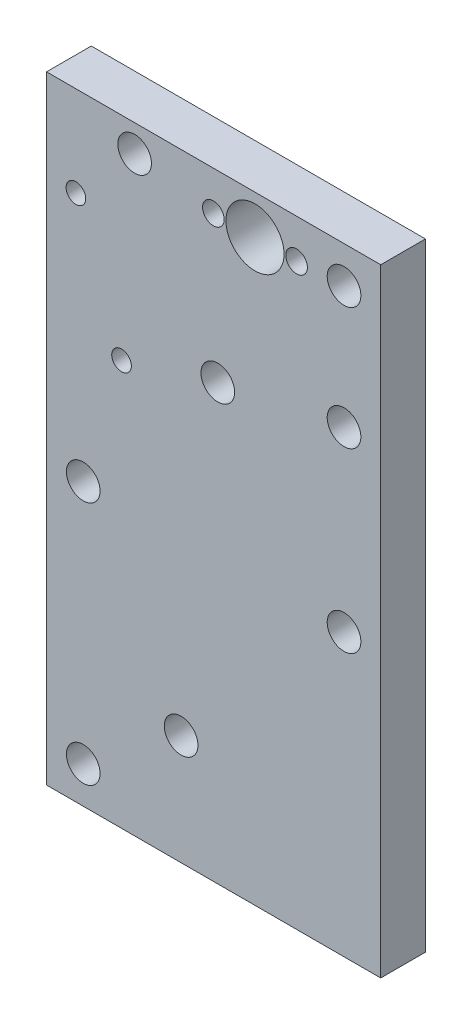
from build123d import *

# Parameters (mm, degrees)
SKETCH1_W           = 86.741
SKETCH1_H           = 160.3375
BOSS_EXTRUDE1_DEPTH = 11.6082064
HOLE11_D            = 5.1054
HOLE12_D            = 15.08125
HOLE13_D            = 5.6134
HOLE14_D            = 8.7376


with BuildPart() as part:
    # Sketch1 → Boss-Extrude1 (new body)
    with BuildSketch(Plane.XY):
        with Locations((-498.6655, -56.03875)):
            Rectangle(SKETCH1_W, SKETCH1_H)
    extrude(amount=BOSS_EXTRUDE1_DEPTH)

    # Hole11 (through all)
    with Locations(Plane(origin=(-531.999112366, 10.292904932, 0), x_dir=(1, 0, 0), z_dir=(0, 0, -1))):
        with Locations((-2.416887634, 9.605745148), (9.426316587, 41.30149722)):
            Hole(HOLE11_D / 2)

    # Hole12 (through all)
    with Locations(Plane(origin=(-491.588260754, 24.571140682, 11.6082064), x_dir=(1, 0, 0), z_dir=(0, 0, 1))):
        with Locations((3.654260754, -10.601140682)):
            Hole(HOLE12_D / 2)

    # Hole13 (through all)
    with Locations(Plane(origin=(-502.383260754, 24.571140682, 11.6082064), x_dir=(1, 0, 0), z_dir=(0, 0, 1))):
        with Locations((3.654260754, -10.601140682), (25.244260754, -10.601140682)):
            Hole(HOLE13_D / 2)

    # Hole14 (through all)
    with Locations(Plane(origin=(-536.165260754, -116.081359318, 11.6082064), x_dir=(1, 0, 0), z_dir=(0, 0, 1))):
        with Locations((3.654260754, -10.601140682), (29.054260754, 8.448859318), (71.345260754, 130.686359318), (16.989260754, 133.226359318), (3.654260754, 52.898859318), (38.579260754, 92.586359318), (71.345260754, 52.898859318), (71.345260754, 98.936359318)):
            Hole(HOLE14_D / 2)


solid = part.part
